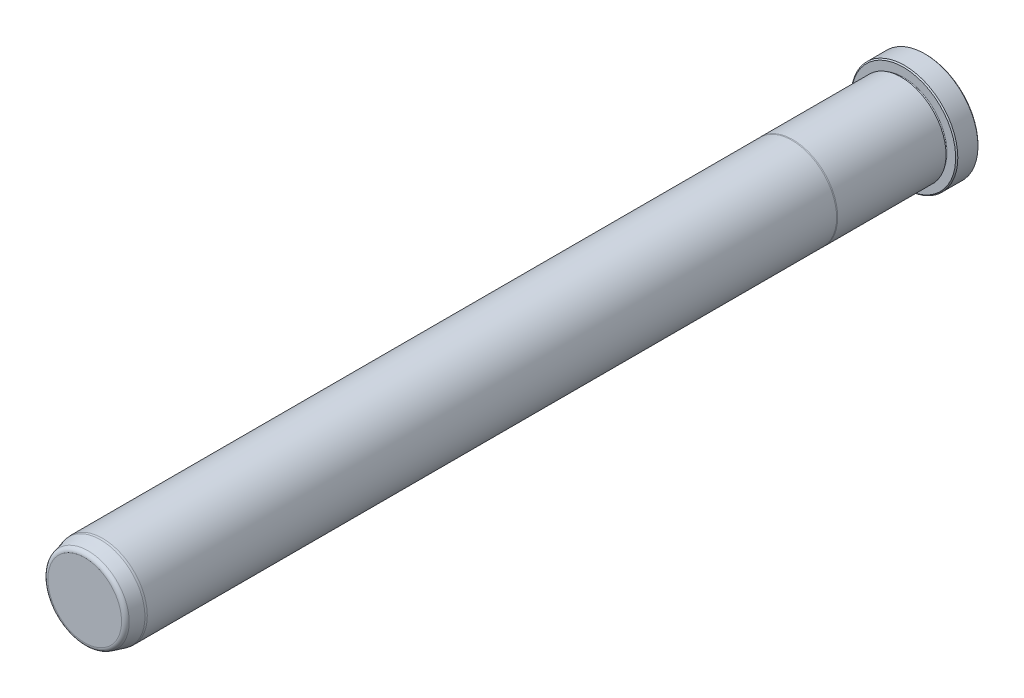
ISO-10303-21;
HEADER;
FILE_DESCRIPTION(('STEP AP214'),'2;1');
FILE_NAME('part.step','',(''),(''),'','','');
FILE_SCHEMA(('AUTOMOTIVE_DESIGN { 1 0 10303 214 1 1 1 1 }'));
ENDSEC;
DATA;
#1=APPLICATION_CONTEXT('core data for automotive mechanical design processes');
#2=APPLICATION_PROTOCOL_DEFINITION('international standard','automotive_design',2000,#1);
#3=PRODUCT_CONTEXT('',#1,'mechanical');
#4=PRODUCT('Part','Part','',(#3));
#5=PRODUCT_RELATED_PRODUCT_CATEGORY('part','',(#4));
#6=PRODUCT_DEFINITION_FORMATION('','',#4);
#7=PRODUCT_DEFINITION_CONTEXT('part definition',#1,'design');
#8=PRODUCT_DEFINITION('design','',#6,#7);
#9=PRODUCT_DEFINITION_SHAPE('','',#8);
#10=(LENGTH_UNIT() NAMED_UNIT(*) SI_UNIT(.MILLI.,.METRE.));
#11=(NAMED_UNIT(*) PLANE_ANGLE_UNIT() SI_UNIT($,.RADIAN.));
#12=(NAMED_UNIT(*) SI_UNIT($,.STERADIAN.) SOLID_ANGLE_UNIT());
#13=UNCERTAINTY_MEASURE_WITH_UNIT(LENGTH_MEASURE(1.E-05),#10,'distance_accuracy_value','');
#14=(GEOMETRIC_REPRESENTATION_CONTEXT(3) GLOBAL_UNCERTAINTY_ASSIGNED_CONTEXT((#13)) GLOBAL_UNIT_ASSIGNED_CONTEXT((#10,
#11,#12)) REPRESENTATION_CONTEXT('',''));
#15=CARTESIAN_POINT('',(0.,0.,0.));
#16=DIRECTION('',(0.,0.,1.));
#17=DIRECTION('',(1.,0.,0.));
#18=AXIS2_PLACEMENT_3D('',#15,#16,#17);
#19=CARTESIAN_POINT('',(0.,0.,0.));
#20=DIRECTION('',(0.,0.,1.));
#21=DIRECTION('',(1.,0.,0.));
#22=AXIS2_PLACEMENT_3D('',#19,#20,#21);
#23=PLANE('',#22);
#24=CARTESIAN_POINT('',(0.,0.,0.));
#25=DIRECTION('',(0.,0.,1.));
#26=DIRECTION('',(1.,0.,0.));
#27=AXIS2_PLACEMENT_3D('',#24,#25,#26);
#28=CIRCLE('',#27,18.5420000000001);
#29=CARTESIAN_POINT('',(18.5420000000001,0.,0.));
#30=VERTEX_POINT('',#29);
#31=EDGE_CURVE('E37',#30,#30,#28,.F.);
#32=ORIENTED_EDGE('',*,*,#31,.T.);
#33=EDGE_LOOP('',(#32));
#34=FACE_BOUND('',#33,.T.);
#35=ADVANCED_FACE('F30',(#34),#23,.F.);
#36=CARTESIAN_POINT('',(0.,0.,0.));
#37=DIRECTION('',(0.,0.,1.));
#38=DIRECTION('',(1.,0.,0.));
#39=AXIS2_PLACEMENT_3D('',#36,#37,#38);
#40=CYLINDRICAL_SURFACE('',#39,18.923);
#41=CARTESIAN_POINT('',(0.,0.,0.380999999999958));
#42=DIRECTION('',(0.,0.,1.));
#43=DIRECTION('',(1.,0.,0.));
#44=AXIS2_PLACEMENT_3D('',#41,#42,#43);
#45=CIRCLE('',#44,18.923);
#46=CARTESIAN_POINT('',(18.923,0.,0.380999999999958));
#47=VERTEX_POINT('',#46);
#48=EDGE_CURVE('E41',#47,#47,#45,.T.);
#49=ORIENTED_EDGE('',*,*,#48,.T.);
#50=EDGE_LOOP('',(#49));
#51=FACE_BOUND('',#50,.T.);
#52=CARTESIAN_POINT('',(0.,0.,7.54379999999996));
#53=DIRECTION('',(0.,0.,-1.));
#54=DIRECTION('',(-1.,0.,0.));
#55=AXIS2_PLACEMENT_3D('',#52,#53,#54);
#56=CIRCLE('',#55,18.923);
#57=CARTESIAN_POINT('',(-18.923,0.,7.54379999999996));
#58=VERTEX_POINT('',#57);
#59=EDGE_CURVE('E45',#58,#58,#56,.T.);
#60=ORIENTED_EDGE('',*,*,#59,.T.);
#61=EDGE_LOOP('',(#60));
#62=FACE_BOUND('',#61,.T.);
#63=ADVANCED_FACE('F118',(#51,#62),#40,.T.);
#64=CARTESIAN_POINT('',(0.,18.923,7.9248));
#65=DIRECTION('',(0.,0.,-1.));
#66=DIRECTION('',(-1.,0.,0.));
#67=AXIS2_PLACEMENT_3D('',#64,#65,#66);
#68=PLANE('',#67);
#69=CARTESIAN_POINT('',(0.,0.,7.9248));
#70=DIRECTION('',(0.,0.,-1.));
#71=DIRECTION('',(-1.,0.,0.));
#72=AXIS2_PLACEMENT_3D('',#69,#70,#71);
#73=CIRCLE('',#72,18.542);
#74=CARTESIAN_POINT('',(-18.542,0.,7.9248));
#75=VERTEX_POINT('',#74);
#76=EDGE_CURVE('E10',#75,#75,#73,.F.);
#77=ORIENTED_EDGE('',*,*,#76,.T.);
#78=EDGE_LOOP('',(#77));
#79=FACE_BOUND('',#78,.T.);
#80=CARTESIAN_POINT('',(0.,0.,7.9248));
#81=DIRECTION('',(0.,0.,1.));
#82=DIRECTION('',(1.,0.,0.));
#83=AXIS2_PLACEMENT_3D('',#80,#81,#82);
#84=CIRCLE('',#83,15.4813);
#85=CARTESIAN_POINT('',(15.4813,0.,7.9248));
#86=VERTEX_POINT('',#85);
#87=EDGE_CURVE('E56',#86,#86,#84,.T.);
#88=ORIENTED_EDGE('',*,*,#87,.F.);
#89=EDGE_LOOP('',(#88));
#90=FACE_BOUND('',#89,.T.);
#91=ADVANCED_FACE('F113',(#79,#90),#68,.F.);
#92=CARTESIAN_POINT('',(0.,0.,8.3058));
#93=DIRECTION('',(0.,0.,1.));
#94=DIRECTION('',(1.,0.,0.));
#95=AXIS2_PLACEMENT_3D('',#92,#93,#94);
#96=TOROIDAL_SURFACE('',#95,15.4813,0.381000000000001);
#97=CARTESIAN_POINT('',(0.,0.,8.6868));
#98=DIRECTION('',(0.,0.,1.));
#99=DIRECTION('',(1.,0.,0.));
#100=AXIS2_PLACEMENT_3D('',#97,#98,#99);
#101=CIRCLE('',#100,15.4813);
#102=CARTESIAN_POINT('',(15.4813,0.,8.6868));
#103=VERTEX_POINT('',#102);
#104=EDGE_CURVE('E59',#103,#103,#101,.T.);
#105=ORIENTED_EDGE('',*,*,#104,.F.);
#106=EDGE_LOOP('',(#105));
#107=FACE_BOUND('',#106,.T.);
#108=ORIENTED_EDGE('',*,*,#87,.T.);
#109=EDGE_LOOP('',(#108));
#110=FACE_BOUND('',#109,.T.);
#111=ADVANCED_FACE('F107',(#107,#110),#96,.F.);
#112=CARTESIAN_POINT('',(0.,15.4813,8.6868));
#113=DIRECTION('',(0.,0.,1.));
#114=DIRECTION('',(1.,0.,0.));
#115=AXIS2_PLACEMENT_3D('',#112,#113,#114);
#116=PLANE('',#115);
#117=CARTESIAN_POINT('',(0.,0.,8.6868));
#118=DIRECTION('',(0.,0.,1.));
#119=DIRECTION('',(1.,0.,0.));
#120=AXIS2_PLACEMENT_3D('',#117,#118,#119);
#121=CIRCLE('',#120,15.8877);
#122=CARTESIAN_POINT('',(15.8877,0.,8.6868));
#123=VERTEX_POINT('',#122);
#124=EDGE_CURVE('E62',#123,#123,#121,.T.);
#125=ORIENTED_EDGE('',*,*,#124,.F.);
#126=EDGE_LOOP('',(#125));
#127=FACE_BOUND('',#126,.T.);
#128=ORIENTED_EDGE('',*,*,#104,.T.);
#129=EDGE_LOOP('',(#128));
#130=FACE_BOUND('',#129,.T.);
#131=ADVANCED_FACE('F101',(#127,#130),#116,.F.);
#132=CARTESIAN_POINT('',(0.,0.,0.));
#133=DIRECTION('',(0.,0.,1.));
#134=DIRECTION('',(1.,0.,0.));
#135=AXIS2_PLACEMENT_3D('',#132,#133,#134);
#136=CYLINDRICAL_SURFACE('',#135,15.8877);
#137=CARTESIAN_POINT('',(0.,0.,47.1347630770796));
#138=DIRECTION('',(0.,0.,1.));
#139=DIRECTION('',(1.,0.,0.));
#140=AXIS2_PLACEMENT_3D('',#137,#138,#139);
#141=CIRCLE('',#140,15.8877);
#142=CARTESIAN_POINT('',(15.8877,0.,47.1347630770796));
#143=VERTEX_POINT('',#142);
#144=EDGE_CURVE('E65',#143,#143,#141,.T.);
#145=ORIENTED_EDGE('',*,*,#144,.F.);
#146=EDGE_LOOP('',(#145));
#147=FACE_BOUND('',#146,.T.);
#148=ORIENTED_EDGE('',*,*,#124,.T.);
#149=EDGE_LOOP('',(#148));
#150=FACE_BOUND('',#149,.T.);
#151=ADVANCED_FACE('F95',(#147,#150),#136,.T.);
#152=CARTESIAN_POINT('',(0.,0.,47.1347630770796));
#153=DIRECTION('',(0.,0.,-1.));
#154=DIRECTION('',(-1.,0.,0.));
#155=AXIS2_PLACEMENT_3D('',#152,#153,#154);
#156=CONICAL_SURFACE('',#155,15.8877,0.0698131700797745);
#157=CARTESIAN_POINT('',(0.,0.,47.498));
#158=DIRECTION('',(0.,0.,1.));
#159=DIRECTION('',(1.,0.,0.));
#160=AXIS2_PLACEMENT_3D('',#157,#158,#159);
#161=CIRCLE('',#160,15.8623);
#162=CARTESIAN_POINT('',(15.8623,0.,47.498));
#163=VERTEX_POINT('',#162);
#164=EDGE_CURVE('E68',#163,#163,#161,.T.);
#165=ORIENTED_EDGE('',*,*,#164,.F.);
#166=EDGE_LOOP('',(#165));
#167=FACE_BOUND('',#166,.T.);
#168=ORIENTED_EDGE('',*,*,#144,.T.);
#169=EDGE_LOOP('',(#168));
#170=FACE_BOUND('',#169,.T.);
#171=ADVANCED_FACE('F89',(#167,#170),#156,.T.);
#172=CARTESIAN_POINT('',(0.,0.,0.));
#173=DIRECTION('',(0.,0.,1.));
#174=DIRECTION('',(1.,0.,0.));
#175=AXIS2_PLACEMENT_3D('',#172,#173,#174);
#176=CYLINDRICAL_SURFACE('',#175,15.8623);
#177=CARTESIAN_POINT('',(0.,0.,292.1));
#178=DIRECTION('',(0.,0.,1.));
#179=DIRECTION('',(1.,0.,0.));
#180=AXIS2_PLACEMENT_3D('',#177,#178,#179);
#181=CIRCLE('',#180,15.8623);
#182=CARTESIAN_POINT('',(15.8623,0.,292.1));
#183=VERTEX_POINT('',#182);
#184=EDGE_CURVE('E71',#183,#183,#181,.T.);
#185=ORIENTED_EDGE('',*,*,#184,.F.);
#186=EDGE_LOOP('',(#185));
#187=FACE_BOUND('',#186,.T.);
#188=ORIENTED_EDGE('',*,*,#164,.T.);
#189=EDGE_LOOP('',(#188));
#190=FACE_BOUND('',#189,.T.);
#191=ADVANCED_FACE('F83',(#187,#190),#176,.T.);
#192=CARTESIAN_POINT('',(0.,0.,292.1));
#193=DIRECTION('',(0.,0.,-1.));
#194=DIRECTION('',(-1.,0.,0.));
#195=AXIS2_PLACEMENT_3D('',#192,#193,#194);
#196=CONICAL_SURFACE('',#195,15.8623,0.0872664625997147);
#197=CARTESIAN_POINT('',(0.,0.,292.862));
#198=DIRECTION('',(0.,0.,1.));
#199=DIRECTION('',(1.,0.,0.));
#200=AXIS2_PLACEMENT_3D('',#197,#198,#199);
#201=CIRCLE('',#200,15.7956336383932);
#202=CARTESIAN_POINT('',(15.7956336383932,0.,292.862));
#203=VERTEX_POINT('',#202);
#204=EDGE_CURVE('E74',#203,#203,#201,.T.);
#205=ORIENTED_EDGE('',*,*,#204,.F.);
#206=EDGE_LOOP('',(#205));
#207=FACE_BOUND('',#206,.T.);
#208=ORIENTED_EDGE('',*,*,#184,.T.);
#209=EDGE_LOOP('',(#208));
#210=FACE_BOUND('',#209,.T.);
#211=ADVANCED_FACE('F80',(#207,#210),#196,.T.);
#212=CARTESIAN_POINT('',(0.,0.,292.862));
#213=DIRECTION('',(0.,0.,-1.));
#214=DIRECTION('',(-1.,0.,0.));
#215=AXIS2_PLACEMENT_3D('',#212,#213,#214);
#216=CONICAL_SURFACE('',#215,15.7956336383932,0.261799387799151);
#217=CARTESIAN_POINT('',(0.,0.,297.2733752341));
#218=DIRECTION('',(0.,0.,1.));
#219=DIRECTION('',(1.,0.,0.));
#220=AXIS2_PLACEMENT_3D('',#217,#218,#219);
#221=CIRCLE('',#220,14.6136092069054);
#222=CARTESIAN_POINT('',(14.6136092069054,0.,297.2733752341));
#223=VERTEX_POINT('',#222);
#224=EDGE_CURVE('E50',#223,#223,#221,.F.);
#225=ORIENTED_EDGE('',*,*,#224,.T.);
#226=EDGE_LOOP('',(#225));
#227=FACE_BOUND('',#226,.T.);
#228=ORIENTED_EDGE('',*,*,#204,.T.);
#229=EDGE_LOOP('',(#228));
#230=FACE_BOUND('',#229,.T.);
#231=ADVANCED_FACE('F78',(#227,#230),#216,.T.);
#232=CARTESIAN_POINT('',(0.,14.2983335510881,298.45));
#233=DIRECTION('',(0.,0.,-1.));
#234=DIRECTION('',(-1.,0.,0.));
#235=AXIS2_PLACEMENT_3D('',#232,#233,#234);
#236=PLANE('',#235);
#237=CARTESIAN_POINT('',(0.,0.,298.45));
#238=DIRECTION('',(0.,0.,-1.));
#239=DIRECTION('',(-1.,0.,0.));
#240=AXIS2_PLACEMENT_3D('',#237,#238,#239);
#241=CIRCLE('',#240,13.0802019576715);
#242=CARTESIAN_POINT('',(-13.0802019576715,0.,298.45));
#243=VERTEX_POINT('',#242);
#244=EDGE_CURVE('E53',#243,#243,#241,.F.);
#245=ORIENTED_EDGE('',*,*,#244,.T.);
#246=EDGE_LOOP('',(#245));
#247=FACE_BOUND('',#246,.T.);
#248=ADVANCED_FACE('F133',(#247),#236,.F.);
#249=CARTESIAN_POINT('',(0.,0.,296.8625));
#250=DIRECTION('',(0.,0.,-1.));
#251=DIRECTION('',(-1.,0.,0.));
#252=AXIS2_PLACEMENT_3D('',#249,#250,#251);
#253=TOROIDAL_SURFACE('',#252,13.0802019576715,1.5875);
#254=ORIENTED_EDGE('',*,*,#224,.F.);
#255=EDGE_LOOP('',(#254));
#256=FACE_BOUND('',#255,.T.);
#257=ORIENTED_EDGE('',*,*,#244,.F.);
#258=EDGE_LOOP('',(#257));
#259=FACE_BOUND('',#258,.T.);
#260=ADVANCED_FACE('F130',(#256,#259),#253,.T.);
#261=CARTESIAN_POINT('',(0.,0.,0.380999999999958));
#262=DIRECTION('',(0.,0.,1.));
#263=DIRECTION('',(1.,0.,0.));
#264=AXIS2_PLACEMENT_3D('',#261,#262,#263);
#265=CONICAL_SURFACE('',#264,18.923,0.785398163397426);
#266=ORIENTED_EDGE('',*,*,#31,.F.);
#267=EDGE_LOOP('',(#266));
#268=FACE_BOUND('',#267,.T.);
#269=ORIENTED_EDGE('',*,*,#48,.F.);
#270=EDGE_LOOP('',(#269));
#271=FACE_BOUND('',#270,.T.);
#272=ADVANCED_FACE('F132',(#268,#271),#265,.T.);
#273=CARTESIAN_POINT('',(0.,0.,7.9248));
#274=DIRECTION('',(0.,0.,-1.));
#275=DIRECTION('',(-1.,0.,0.));
#276=AXIS2_PLACEMENT_3D('',#273,#274,#275);
#277=CONICAL_SURFACE('',#276,18.542,0.785398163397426);
#278=ORIENTED_EDGE('',*,*,#59,.F.);
#279=EDGE_LOOP('',(#278));
#280=FACE_BOUND('',#279,.T.);
#281=ORIENTED_EDGE('',*,*,#76,.F.);
#282=EDGE_LOOP('',(#281));
#283=FACE_BOUND('',#282,.T.);
#284=ADVANCED_FACE('F32',(#280,#283),#277,.T.);
#285=CLOSED_SHELL('',(#35,#63,#91,#111,#131,#151,#171,#191,#211,#231,#248,#260,#272,#284));
#286=MANIFOLD_SOLID_BREP('B2',#285);
#287=ADVANCED_BREP_SHAPE_REPRESENTATION('',(#18,#286),#14);
#288=SHAPE_DEFINITION_REPRESENTATION(#9,#287);
ENDSEC;
END-ISO-10303-21;
